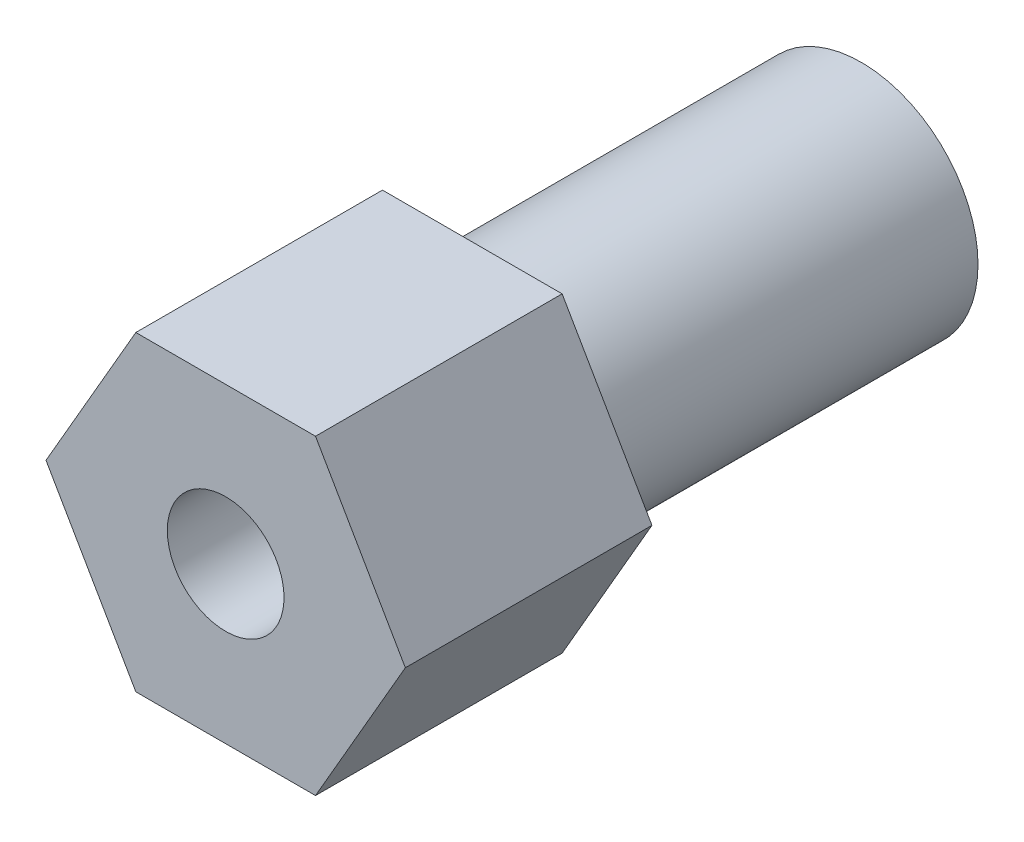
ISO-10303-21;
HEADER;
FILE_DESCRIPTION(('STEP AP214'),'2;1');
FILE_NAME('part.step','',(''),(''),'','','');
FILE_SCHEMA(('AUTOMOTIVE_DESIGN { 1 0 10303 214 1 1 1 1 }'));
ENDSEC;
DATA;
#1=APPLICATION_CONTEXT('core data for automotive mechanical design processes');
#2=APPLICATION_PROTOCOL_DEFINITION('international standard','automotive_design',2000,#1);
#3=PRODUCT_CONTEXT('',#1,'mechanical');
#4=PRODUCT('Part','Part','',(#3));
#5=PRODUCT_RELATED_PRODUCT_CATEGORY('part','',(#4));
#6=PRODUCT_DEFINITION_FORMATION('','',#4);
#7=PRODUCT_DEFINITION_CONTEXT('part definition',#1,'design');
#8=PRODUCT_DEFINITION('design','',#6,#7);
#9=PRODUCT_DEFINITION_SHAPE('','',#8);
#10=(LENGTH_UNIT() NAMED_UNIT(*) SI_UNIT(.MILLI.,.METRE.));
#11=(NAMED_UNIT(*) PLANE_ANGLE_UNIT() SI_UNIT($,.RADIAN.));
#12=(NAMED_UNIT(*) SI_UNIT($,.STERADIAN.) SOLID_ANGLE_UNIT());
#13=UNCERTAINTY_MEASURE_WITH_UNIT(LENGTH_MEASURE(1.E-05),#10,'distance_accuracy_value','');
#14=(GEOMETRIC_REPRESENTATION_CONTEXT(3) GLOBAL_UNCERTAINTY_ASSIGNED_CONTEXT((#13)) GLOBAL_UNIT_ASSIGNED_CONTEXT((#10,
#11,#12)) REPRESENTATION_CONTEXT('',''));
#15=CARTESIAN_POINT('',(0.,0.,0.));
#16=DIRECTION('',(0.,0.,1.));
#17=DIRECTION('',(1.,0.,0.));
#18=AXIS2_PLACEMENT_3D('',#15,#16,#17);
#19=CARTESIAN_POINT('',(-2.30940107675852,-4.00000000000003,0.));
#20=DIRECTION('',(0.,0.,-0.999999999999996));
#21=DIRECTION('',(-0.999999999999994,0.,0.));
#22=AXIS2_PLACEMENT_3D('',#19,#20,#21);
#23=PLANE('',#22);
#24=DIRECTION('',(0.999999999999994,0.,0.));
#25=VECTOR('',#24,1.);
#26=CARTESIAN_POINT('',(-2.30940107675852,-4.00000000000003,0.));
#27=LINE('',#26,#25);
#28=CARTESIAN_POINT('',(-2.30940107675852,-4.00000000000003,0.));
#29=VERTEX_POINT('',#28);
#30=CARTESIAN_POINT('',(2.3094010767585,-4.,0.));
#31=VERTEX_POINT('',#30);
#32=EDGE_CURVE('E89',#29,#31,#27,.T.);
#33=ORIENTED_EDGE('',*,*,#32,.F.);
#34=DIRECTION('',(0.499999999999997,-0.866025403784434,0.));
#35=VECTOR('',#34,1.);
#36=CARTESIAN_POINT('',(-4.61880215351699,0.,0.));
#37=LINE('',#36,#35);
#38=CARTESIAN_POINT('',(-4.61880215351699,0.,0.));
#39=VERTEX_POINT('',#38);
#40=EDGE_CURVE('E115',#39,#29,#37,.T.);
#41=ORIENTED_EDGE('',*,*,#40,.F.);
#42=DIRECTION('',(-0.499999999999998,-0.866025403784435,0.));
#43=VECTOR('',#42,1.);
#44=CARTESIAN_POINT('',(-2.30940107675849,3.99999999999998,0.));
#45=LINE('',#44,#43);
#46=CARTESIAN_POINT('',(-2.30940107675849,3.99999999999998,0.));
#47=VERTEX_POINT('',#46);
#48=EDGE_CURVE('E113',#47,#39,#45,.T.);
#49=ORIENTED_EDGE('',*,*,#48,.F.);
#50=DIRECTION('',(-0.999999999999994,0.,0.));
#51=VECTOR('',#50,1.);
#52=CARTESIAN_POINT('',(2.30940107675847,3.99999999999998,0.));
#53=LINE('',#52,#51);
#54=CARTESIAN_POINT('',(2.30940107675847,3.99999999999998,0.));
#55=VERTEX_POINT('',#54);
#56=EDGE_CURVE('E111',#55,#47,#53,.T.);
#57=ORIENTED_EDGE('',*,*,#56,.F.);
#58=DIRECTION('',(-0.499999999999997,0.866025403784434,0.));
#59=VECTOR('',#58,1.);
#60=CARTESIAN_POINT('',(4.61880215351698,0.,0.));
#61=LINE('',#60,#59);
#62=CARTESIAN_POINT('',(4.61880215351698,0.,0.));
#63=VERTEX_POINT('',#62);
#64=EDGE_CURVE('E91',#63,#55,#61,.T.);
#65=ORIENTED_EDGE('',*,*,#64,.F.);
#66=DIRECTION('',(0.499999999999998,0.866025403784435,0.));
#67=VECTOR('',#66,1.);
#68=CARTESIAN_POINT('',(2.3094010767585,-4.,0.));
#69=LINE('',#68,#67);
#70=EDGE_CURVE('E85',#31,#63,#69,.T.);
#71=ORIENTED_EDGE('',*,*,#70,.F.);
#72=EDGE_LOOP('',(#33,#41,#49,#57,#65,#71));
#73=FACE_BOUND('',#72,.T.);
#74=CARTESIAN_POINT('',(0.,0.,0.));
#75=DIRECTION('',(0.,0.,-0.999999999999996));
#76=DIRECTION('',(-0.999999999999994,0.,0.));
#77=AXIS2_PLACEMENT_3D('',#74,#75,#76);
#78=CIRCLE('',#77,3.);
#79=CARTESIAN_POINT('',(2.99999999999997,0.,0.));
#80=VERTEX_POINT('',#79);
#81=EDGE_CURVE('E106',#80,#80,#78,.T.);
#82=ORIENTED_EDGE('',*,*,#81,.F.);
#83=EDGE_LOOP('',(#82));
#84=FACE_BOUND('',#83,.T.);
#85=ADVANCED_FACE('F32',(#73,#84),#23,.T.);
#86=CARTESIAN_POINT('',(-2.30940107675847,-3.99999999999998,6.33999999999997));
#87=DIRECTION('',(0.,0.999999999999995,0.));
#88=DIRECTION('',(-0.999999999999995,0.,0.));
#89=AXIS2_PLACEMENT_3D('',#86,#87,#88);
#90=PLANE('',#89);
#91=ORIENTED_EDGE('',*,*,#32,.T.);
#92=DIRECTION('',(0.,0.,-0.999999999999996));
#93=VECTOR('',#92,1.);
#94=CARTESIAN_POINT('',(2.30940107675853,-3.99999999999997,6.33999999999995));
#95=LINE('',#94,#93);
#96=CARTESIAN_POINT('',(2.30940107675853,-3.99999999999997,6.33999999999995));
#97=VERTEX_POINT('',#96);
#98=EDGE_CURVE('E11',#97,#31,#95,.T.);
#99=ORIENTED_EDGE('',*,*,#98,.F.);
#100=DIRECTION('',(0.999999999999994,0.,0.));
#101=VECTOR('',#100,1.);
#102=CARTESIAN_POINT('',(-2.30940107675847,-3.99999999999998,6.33999999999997));
#103=LINE('',#102,#101);
#104=CARTESIAN_POINT('',(-2.30940107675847,-3.99999999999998,6.33999999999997));
#105=VERTEX_POINT('',#104);
#106=EDGE_CURVE('E117',#105,#97,#103,.T.);
#107=ORIENTED_EDGE('',*,*,#106,.F.);
#108=DIRECTION('',(0.,0.,-0.999999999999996));
#109=VECTOR('',#108,1.);
#110=CARTESIAN_POINT('',(-2.30940107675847,-3.99999999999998,6.33999999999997));
#111=LINE('',#110,#109);
#112=EDGE_CURVE('E102',#105,#29,#111,.T.);
#113=ORIENTED_EDGE('',*,*,#112,.T.);
#114=EDGE_LOOP('',(#91,#99,#107,#113));
#115=FACE_BOUND('',#114,.T.);
#116=ADVANCED_FACE('F34',(#115),#90,.F.);
#117=CARTESIAN_POINT('',(2.30940107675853,-3.99999999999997,6.33999999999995));
#118=DIRECTION('',(-0.866025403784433,0.499999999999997,0.));
#119=DIRECTION('',(-0.499999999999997,-0.866025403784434,0.));
#120=AXIS2_PLACEMENT_3D('',#117,#118,#119);
#121=PLANE('',#120);
#122=ORIENTED_EDGE('',*,*,#70,.T.);
#123=DIRECTION('',(0.,0.,-0.999999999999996));
#124=VECTOR('',#123,1.);
#125=CARTESIAN_POINT('',(4.61880215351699,0.,6.33999999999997));
#126=LINE('',#125,#124);
#127=CARTESIAN_POINT('',(4.61880215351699,0.,6.33999999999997));
#128=VERTEX_POINT('',#127);
#129=EDGE_CURVE('E40',#128,#63,#126,.T.);
#130=ORIENTED_EDGE('',*,*,#129,.F.);
#131=DIRECTION('',(0.499999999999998,0.866025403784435,0.));
#132=VECTOR('',#131,1.);
#133=CARTESIAN_POINT('',(2.30940107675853,-3.99999999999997,6.33999999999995));
#134=LINE('',#133,#132);
#135=EDGE_CURVE('E98',#97,#128,#134,.T.);
#136=ORIENTED_EDGE('',*,*,#135,.F.);
#137=ORIENTED_EDGE('',*,*,#98,.T.);
#138=EDGE_LOOP('',(#122,#130,#136,#137));
#139=FACE_BOUND('',#138,.T.);
#140=ADVANCED_FACE('F97',(#139),#121,.F.);
#141=CARTESIAN_POINT('',(4.61880215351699,0.,6.33999999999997));
#142=DIRECTION('',(-0.866025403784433,-0.499999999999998,0.));
#143=DIRECTION('',(0.499999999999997,-0.866025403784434,0.));
#144=AXIS2_PLACEMENT_3D('',#141,#142,#143);
#145=PLANE('',#144);
#146=ORIENTED_EDGE('',*,*,#64,.T.);
#147=DIRECTION('',(0.,0.,-0.999999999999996));
#148=VECTOR('',#147,1.);
#149=CARTESIAN_POINT('',(2.30940107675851,3.99999999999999,6.33999999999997));
#150=LINE('',#149,#148);
#151=CARTESIAN_POINT('',(2.30940107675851,3.99999999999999,6.33999999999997));
#152=VERTEX_POINT('',#151);
#153=EDGE_CURVE('E133',#152,#55,#150,.T.);
#154=ORIENTED_EDGE('',*,*,#153,.F.);
#155=DIRECTION('',(-0.499999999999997,0.866025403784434,0.));
#156=VECTOR('',#155,1.);
#157=CARTESIAN_POINT('',(4.61880215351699,0.,6.33999999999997));
#158=LINE('',#157,#156);
#159=EDGE_CURVE('E120',#128,#152,#158,.T.);
#160=ORIENTED_EDGE('',*,*,#159,.F.);
#161=ORIENTED_EDGE('',*,*,#129,.T.);
#162=EDGE_LOOP('',(#146,#154,#160,#161));
#163=FACE_BOUND('',#162,.T.);
#164=ADVANCED_FACE('F137',(#163),#145,.F.);
#165=CARTESIAN_POINT('',(2.30940107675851,3.99999999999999,6.33999999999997));
#166=DIRECTION('',(0.,-0.999999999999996,0.));
#167=DIRECTION('',(0.,0.,-0.999999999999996));
#168=AXIS2_PLACEMENT_3D('',#165,#166,#167);
#169=PLANE('',#168);
#170=ORIENTED_EDGE('',*,*,#56,.T.);
#171=DIRECTION('',(0.,0.,-0.999999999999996));
#172=VECTOR('',#171,1.);
#173=CARTESIAN_POINT('',(-2.30940107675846,3.99999999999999,6.34000000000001));
#174=LINE('',#173,#172);
#175=CARTESIAN_POINT('',(-2.30940107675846,3.99999999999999,6.34000000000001));
#176=VERTEX_POINT('',#175);
#177=EDGE_CURVE('E130',#176,#47,#174,.T.);
#178=ORIENTED_EDGE('',*,*,#177,.F.);
#179=DIRECTION('',(-0.999999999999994,0.,0.));
#180=VECTOR('',#179,1.);
#181=CARTESIAN_POINT('',(2.30940107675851,3.99999999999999,6.33999999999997));
#182=LINE('',#181,#180);
#183=EDGE_CURVE('E122',#152,#176,#182,.T.);
#184=ORIENTED_EDGE('',*,*,#183,.F.);
#185=ORIENTED_EDGE('',*,*,#153,.T.);
#186=EDGE_LOOP('',(#170,#178,#184,#185));
#187=FACE_BOUND('',#186,.T.);
#188=ADVANCED_FACE('F143',(#187),#169,.F.);
#189=CARTESIAN_POINT('',(-2.30940107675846,3.99999999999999,6.34000000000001));
#190=DIRECTION('',(0.866025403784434,-0.499999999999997,0.));
#191=DIRECTION('',(0.499999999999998,0.866025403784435,0.));
#192=AXIS2_PLACEMENT_3D('',#189,#190,#191);
#193=PLANE('',#192);
#194=ORIENTED_EDGE('',*,*,#48,.T.);
#195=DIRECTION('',(0.,0.,-0.999999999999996));
#196=VECTOR('',#195,1.);
#197=CARTESIAN_POINT('',(-4.61880215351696,0.,6.33999999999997));
#198=LINE('',#197,#196);
#199=CARTESIAN_POINT('',(-4.61880215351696,0.,6.33999999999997));
#200=VERTEX_POINT('',#199);
#201=EDGE_CURVE('E127',#200,#39,#198,.T.);
#202=ORIENTED_EDGE('',*,*,#201,.F.);
#203=DIRECTION('',(-0.499999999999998,-0.866025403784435,0.));
#204=VECTOR('',#203,1.);
#205=CARTESIAN_POINT('',(-2.30940107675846,3.99999999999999,6.34000000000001));
#206=LINE('',#205,#204);
#207=EDGE_CURVE('E52',#176,#200,#206,.T.);
#208=ORIENTED_EDGE('',*,*,#207,.F.);
#209=ORIENTED_EDGE('',*,*,#177,.T.);
#210=EDGE_LOOP('',(#194,#202,#208,#209));
#211=FACE_BOUND('',#210,.T.);
#212=ADVANCED_FACE('F146',(#211),#193,.F.);
#213=CARTESIAN_POINT('',(-4.61880215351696,0.,6.33999999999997));
#214=DIRECTION('',(0.866025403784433,0.499999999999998,0.));
#215=DIRECTION('',(-0.499999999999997,0.866025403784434,0.));
#216=AXIS2_PLACEMENT_3D('',#213,#214,#215);
#217=PLANE('',#216);
#218=ORIENTED_EDGE('',*,*,#40,.T.);
#219=ORIENTED_EDGE('',*,*,#112,.F.);
#220=DIRECTION('',(0.499999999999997,-0.866025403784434,0.));
#221=VECTOR('',#220,1.);
#222=CARTESIAN_POINT('',(-4.61880215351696,0.,6.33999999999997));
#223=LINE('',#222,#221);
#224=EDGE_CURVE('E47',#200,#105,#223,.T.);
#225=ORIENTED_EDGE('',*,*,#224,.F.);
#226=ORIENTED_EDGE('',*,*,#201,.T.);
#227=EDGE_LOOP('',(#218,#219,#225,#226));
#228=FACE_BOUND('',#227,.T.);
#229=ADVANCED_FACE('F148',(#228),#217,.F.);
#230=CARTESIAN_POINT('',(-2.30940107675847,-3.99999999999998,6.33999999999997));
#231=DIRECTION('',(0.,0.,-0.999999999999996));
#232=DIRECTION('',(-0.999999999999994,0.,0.));
#233=AXIS2_PLACEMENT_3D('',#230,#231,#232);
#234=PLANE('',#233);
#235=CARTESIAN_POINT('',(0.,0.,6.33999999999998));
#236=DIRECTION('',(0.,0.,-0.999999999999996));
#237=DIRECTION('',(-0.999999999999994,0.,0.));
#238=AXIS2_PLACEMENT_3D('',#235,#236,#237);
#239=CIRCLE('',#238,1.5);
#240=CARTESIAN_POINT('',(-1.49999999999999,0.,6.33999999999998));
#241=VERTEX_POINT('',#240);
#242=EDGE_CURVE('E180',#241,#241,#239,.T.);
#243=ORIENTED_EDGE('',*,*,#242,.T.);
#244=EDGE_LOOP('',(#243));
#245=FACE_BOUND('',#244,.T.);
#246=ORIENTED_EDGE('',*,*,#106,.T.);
#247=ORIENTED_EDGE('',*,*,#135,.T.);
#248=ORIENTED_EDGE('',*,*,#159,.T.);
#249=ORIENTED_EDGE('',*,*,#183,.T.);
#250=ORIENTED_EDGE('',*,*,#207,.T.);
#251=ORIENTED_EDGE('',*,*,#224,.T.);
#252=EDGE_LOOP('',(#246,#247,#248,#249,#250,#251));
#253=FACE_BOUND('',#252,.T.);
#254=ADVANCED_FACE('F140',(#245,#253),#234,.F.);
#255=CARTESIAN_POINT('',(0.,0.,-9.99999999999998));
#256=DIRECTION('',(0.,0.,0.999999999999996));
#257=DIRECTION('',(0.999999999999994,0.,0.));
#258=AXIS2_PLACEMENT_3D('',#255,#256,#257);
#259=CYLINDRICAL_SURFACE('',#258,3.);
#260=CARTESIAN_POINT('',(0.,0.,-9.99999999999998));
#261=DIRECTION('',(0.,0.,-0.999999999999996));
#262=DIRECTION('',(-0.999999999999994,0.,0.));
#263=AXIS2_PLACEMENT_3D('',#260,#261,#262);
#264=CIRCLE('',#263,3.);
#265=CARTESIAN_POINT('',(2.99999999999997,0.,-9.99999999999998));
#266=VERTEX_POINT('',#265);
#267=EDGE_CURVE('E103',#266,#266,#264,.T.);
#268=CARTESIAN_POINT('',(2.99999999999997,0.,-9.99999999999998));
#269=CARTESIAN_POINT('',(2.99999999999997,0.,-9.89583333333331));
#270=CARTESIAN_POINT('',(2.99999999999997,0.,-9.79166666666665));
#271=CARTESIAN_POINT('',(2.99999999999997,0.,-9.58333333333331));
#272=CARTESIAN_POINT('',(2.99999999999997,0.,-9.47916666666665));
#273=CARTESIAN_POINT('',(2.99999999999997,0.,-9.27083333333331));
#274=CARTESIAN_POINT('',(2.99999999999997,0.,-9.16666666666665));
#275=CARTESIAN_POINT('',(2.99999999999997,0.,-8.95833333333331));
#276=CARTESIAN_POINT('',(2.99999999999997,0.,-8.85416666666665));
#277=CARTESIAN_POINT('',(2.99999999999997,0.,-8.64583333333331));
#278=CARTESIAN_POINT('',(2.99999999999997,0.,-8.54166666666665));
#279=CARTESIAN_POINT('',(2.99999999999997,0.,-8.33333333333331));
#280=CARTESIAN_POINT('',(2.99999999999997,0.,-8.22916666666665));
#281=CARTESIAN_POINT('',(2.99999999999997,0.,-8.02083333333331));
#282=CARTESIAN_POINT('',(2.99999999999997,0.,-7.91666666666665));
#283=CARTESIAN_POINT('',(2.99999999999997,0.,-7.70833333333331));
#284=CARTESIAN_POINT('',(2.99999999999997,0.,-7.60416666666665));
#285=CARTESIAN_POINT('',(2.99999999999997,0.,-7.39583333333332));
#286=CARTESIAN_POINT('',(2.99999999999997,0.,-7.29166666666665));
#287=CARTESIAN_POINT('',(2.99999999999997,0.,-7.08333333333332));
#288=CARTESIAN_POINT('',(2.99999999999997,0.,-6.97916666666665));
#289=CARTESIAN_POINT('',(2.99999999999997,0.,-6.77083333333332));
#290=CARTESIAN_POINT('',(2.99999999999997,0.,-6.66666666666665));
#291=CARTESIAN_POINT('',(2.99999999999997,0.,-6.45833333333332));
#292=CARTESIAN_POINT('',(2.99999999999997,0.,-6.35416666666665));
#293=CARTESIAN_POINT('',(2.99999999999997,0.,-6.14583333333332));
#294=CARTESIAN_POINT('',(2.99999999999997,0.,-6.04166666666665));
#295=CARTESIAN_POINT('',(2.99999999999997,0.,-5.83333333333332));
#296=CARTESIAN_POINT('',(2.99999999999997,0.,-5.72916666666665));
#297=CARTESIAN_POINT('',(2.99999999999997,0.,-5.52083333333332));
#298=CARTESIAN_POINT('',(2.99999999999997,0.,-5.41666666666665));
#299=CARTESIAN_POINT('',(2.99999999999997,0.,-5.20833333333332));
#300=CARTESIAN_POINT('',(2.99999999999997,0.,-5.10416666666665));
#301=CARTESIAN_POINT('',(2.99999999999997,0.,-4.89583333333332));
#302=CARTESIAN_POINT('',(2.99999999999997,0.,-4.79166666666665));
#303=CARTESIAN_POINT('',(2.99999999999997,0.,-4.58333333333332));
#304=CARTESIAN_POINT('',(2.99999999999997,0.,-4.47916666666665));
#305=CARTESIAN_POINT('',(2.99999999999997,0.,-4.27083333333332));
#306=CARTESIAN_POINT('',(2.99999999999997,0.,-4.16666666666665));
#307=CARTESIAN_POINT('',(2.99999999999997,0.,-3.95833333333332));
#308=CARTESIAN_POINT('',(2.99999999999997,0.,-3.85416666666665));
#309=CARTESIAN_POINT('',(2.99999999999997,0.,-3.64583333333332));
#310=CARTESIAN_POINT('',(2.99999999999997,0.,-3.54166666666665));
#311=CARTESIAN_POINT('',(2.99999999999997,0.,-3.33333333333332));
#312=CARTESIAN_POINT('',(2.99999999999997,0.,-3.22916666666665));
#313=CARTESIAN_POINT('',(2.99999999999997,0.,-3.02083333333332));
#314=CARTESIAN_POINT('',(2.99999999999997,0.,-2.91666666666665));
#315=CARTESIAN_POINT('',(2.99999999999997,0.,-2.70833333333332));
#316=CARTESIAN_POINT('',(2.99999999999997,0.,-2.60416666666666));
#317=CARTESIAN_POINT('',(2.99999999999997,0.,-2.39583333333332));
#318=CARTESIAN_POINT('',(2.99999999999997,0.,-2.29166666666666));
#319=CARTESIAN_POINT('',(2.99999999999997,0.,-2.08333333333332));
#320=CARTESIAN_POINT('',(2.99999999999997,0.,-1.97916666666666));
#321=CARTESIAN_POINT('',(2.99999999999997,0.,-1.77083333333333));
#322=CARTESIAN_POINT('',(2.99999999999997,0.,-1.66666666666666));
#323=CARTESIAN_POINT('',(2.99999999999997,0.,-1.45833333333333));
#324=CARTESIAN_POINT('',(2.99999999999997,0.,-1.35416666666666));
#325=CARTESIAN_POINT('',(2.99999999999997,0.,-1.14583333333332));
#326=CARTESIAN_POINT('',(2.99999999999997,0.,-1.04166666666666));
#327=CARTESIAN_POINT('',(2.99999999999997,0.,-0.833333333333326));
#328=CARTESIAN_POINT('',(2.99999999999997,0.,-0.72916666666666));
#329=CARTESIAN_POINT('',(2.99999999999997,0.,-0.520833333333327));
#330=CARTESIAN_POINT('',(2.99999999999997,0.,-0.41666666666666));
#331=CARTESIAN_POINT('',(2.99999999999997,0.,-0.208333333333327));
#332=CARTESIAN_POINT('',(2.99999999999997,0.,-0.10416666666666));
#333=CARTESIAN_POINT('',(2.99999999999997,0.,0.));
#334=B_SPLINE_CURVE_WITH_KNOTS('',3,(#268,#269,#270,#271,#272,#273,#274,#275,#276,#277,#278,
#279,#280,#281,#282,#283,#284,#285,#286,#287,#288,#289,#290,#291,#292,#293,#294,#295,#296,#297,
#298,#299,#300,#301,#302,#303,#304,#305,#306,#307,#308,#309,#310,#311,#312,#313,#314,#315,#316,
#317,#318,#319,#320,#321,#322,#323,#324,#325,#326,#327,#328,#329,#330,#331,#332,#333),
.UNSPECIFIED.,.F.,.F.,(4,2,2,2,2,2,2,2,2,2,2,2,2,2,2,2,2,2,2,2,2,2,2,2,2,2,2,2,2,2,2,2,4),(0.,
0.3125,0.625000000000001,0.937499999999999,1.25,1.5625,1.875,2.1875,2.5,2.8125,3.125,3.4375,
3.75,4.06249999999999,4.375,4.68749999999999,4.99999999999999,5.31249999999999,5.62499999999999,
5.93749999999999,6.24999999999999,6.56249999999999,6.87499999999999,7.18749999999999,
7.49999999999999,7.81249999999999,8.12499999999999,8.43749999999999,8.74999999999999,
9.06249999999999,9.37499999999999,9.68749999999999,9.99999999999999),.UNSPECIFIED.);
#335=EDGE_CURVE('BSEAM155',#266,#80,#334,.T.);
#336=ORIENTED_EDGE('',*,*,#267,.F.);
#337=ORIENTED_EDGE('',*,*,#81,.T.);
#338=ORIENTED_EDGE('',*,*,#335,.T.);
#339=ORIENTED_EDGE('',*,*,#335,.F.);
#340=EDGE_LOOP('',(#336,#338,#337,#339));
#341=FACE_BOUND('',#340,.T.);
#342=ADVANCED_FACE('F155',(#341),#259,.T.);
#343=CARTESIAN_POINT('',(0.,0.,-9.99999999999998));
#344=DIRECTION('',(0.,0.,-0.999999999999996));
#345=DIRECTION('',(-0.999999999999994,0.,0.));
#346=AXIS2_PLACEMENT_3D('',#343,#344,#345);
#347=PLANE('',#346);
#348=CARTESIAN_POINT('',(0.,0.,-9.99999999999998));
#349=DIRECTION('',(0.,0.,-0.999999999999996));
#350=DIRECTION('',(-0.999999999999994,0.,0.));
#351=AXIS2_PLACEMENT_3D('',#348,#349,#350);
#352=CIRCLE('',#351,1.5);
#353=CARTESIAN_POINT('',(-1.49999999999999,0.,-9.99999999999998));
#354=VERTEX_POINT('',#353);
#355=EDGE_CURVE('E183',#354,#354,#352,.T.);
#356=ORIENTED_EDGE('',*,*,#355,.F.);
#357=EDGE_LOOP('',(#356));
#358=FACE_BOUND('',#357,.T.);
#359=ORIENTED_EDGE('',*,*,#267,.T.);
#360=EDGE_LOOP('',(#359));
#361=FACE_BOUND('',#360,.T.);
#362=ADVANCED_FACE('F167',(#358,#361),#347,.T.);
#363=CARTESIAN_POINT('',(0.,0.,6.33999999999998));
#364=DIRECTION('',(0.,0.,-0.999999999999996));
#365=DIRECTION('',(-0.999999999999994,0.,0.));
#366=AXIS2_PLACEMENT_3D('',#363,#364,#365);
#367=CYLINDRICAL_SURFACE('',#366,1.5);
#368=CARTESIAN_POINT('',(-1.49999999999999,0.,6.33999999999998));
#369=CARTESIAN_POINT('',(-1.49999999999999,0.,6.16979166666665));
#370=CARTESIAN_POINT('',(-1.49999999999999,0.,5.99958333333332));
#371=CARTESIAN_POINT('',(-1.49999999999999,0.,5.65916666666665));
#372=CARTESIAN_POINT('',(-1.49999999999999,0.,5.48895833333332));
#373=CARTESIAN_POINT('',(-1.49999999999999,0.,5.14854166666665));
#374=CARTESIAN_POINT('',(-1.49999999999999,0.,4.97833333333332));
#375=CARTESIAN_POINT('',(-1.49999999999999,0.,4.63791666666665));
#376=CARTESIAN_POINT('',(-1.49999999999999,0.,4.46770833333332));
#377=CARTESIAN_POINT('',(-1.49999999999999,0.,4.12729166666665));
#378=CARTESIAN_POINT('',(-1.49999999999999,0.,3.95708333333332));
#379=CARTESIAN_POINT('',(-1.49999999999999,0.,3.61666666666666));
#380=CARTESIAN_POINT('',(-1.49999999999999,0.,3.44645833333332));
#381=CARTESIAN_POINT('',(-1.49999999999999,0.,3.10604166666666));
#382=CARTESIAN_POINT('',(-1.49999999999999,0.,2.93583333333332));
#383=CARTESIAN_POINT('',(-1.49999999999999,0.,2.59541666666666));
#384=CARTESIAN_POINT('',(-1.49999999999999,0.,2.42520833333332));
#385=CARTESIAN_POINT('',(-1.49999999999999,0.,2.08479166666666));
#386=CARTESIAN_POINT('',(-1.49999999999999,0.,1.91458333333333));
#387=CARTESIAN_POINT('',(-1.49999999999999,0.,1.57416666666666));
#388=CARTESIAN_POINT('',(-1.49999999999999,0.,1.40395833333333));
#389=CARTESIAN_POINT('',(-1.49999999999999,0.,1.06354166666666));
#390=CARTESIAN_POINT('',(-1.49999999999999,0.,0.893333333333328));
#391=CARTESIAN_POINT('',(-1.49999999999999,0.,0.552916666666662));
#392=CARTESIAN_POINT('',(-1.49999999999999,0.,0.382708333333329));
#393=CARTESIAN_POINT('',(-1.49999999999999,0.,0.0422916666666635));
#394=CARTESIAN_POINT('',(-1.49999999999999,0.,-0.127916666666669));
#395=CARTESIAN_POINT('',(-1.49999999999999,0.,-0.468333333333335));
#396=CARTESIAN_POINT('',(-1.49999999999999,0.,-0.638541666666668));
#397=CARTESIAN_POINT('',(-1.49999999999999,0.,-0.978958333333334));
#398=CARTESIAN_POINT('',(-1.49999999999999,0.,-1.14916666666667));
#399=CARTESIAN_POINT('',(-1.49999999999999,0.,-1.48958333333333));
#400=CARTESIAN_POINT('',(-1.49999999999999,0.,-1.65979166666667));
#401=CARTESIAN_POINT('',(-1.49999999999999,0.,-2.00020833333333));
#402=CARTESIAN_POINT('',(-1.49999999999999,0.,-2.17041666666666));
#403=CARTESIAN_POINT('',(-1.49999999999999,0.,-2.51083333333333));
#404=CARTESIAN_POINT('',(-1.49999999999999,0.,-2.68104166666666));
#405=CARTESIAN_POINT('',(-1.49999999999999,0.,-3.02145833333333));
#406=CARTESIAN_POINT('',(-1.49999999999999,0.,-3.19166666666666));
#407=CARTESIAN_POINT('',(-1.49999999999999,0.,-3.53208333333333));
#408=CARTESIAN_POINT('',(-1.49999999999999,0.,-3.70229166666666));
#409=CARTESIAN_POINT('',(-1.49999999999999,0.,-4.04270833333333));
#410=CARTESIAN_POINT('',(-1.49999999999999,0.,-4.21291666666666));
#411=CARTESIAN_POINT('',(-1.49999999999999,0.,-4.55333333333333));
#412=CARTESIAN_POINT('',(-1.49999999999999,0.,-4.72354166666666));
#413=CARTESIAN_POINT('',(-1.49999999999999,0.,-5.06395833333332));
#414=CARTESIAN_POINT('',(-1.49999999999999,0.,-5.23416666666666));
#415=CARTESIAN_POINT('',(-1.49999999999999,0.,-5.57458333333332));
#416=CARTESIAN_POINT('',(-1.49999999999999,0.,-5.74479166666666));
#417=CARTESIAN_POINT('',(-1.49999999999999,0.,-6.08520833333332));
#418=CARTESIAN_POINT('',(-1.49999999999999,0.,-6.25541666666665));
#419=CARTESIAN_POINT('',(-1.49999999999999,0.,-6.59583333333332));
#420=CARTESIAN_POINT('',(-1.49999999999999,0.,-6.76604166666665));
#421=CARTESIAN_POINT('',(-1.49999999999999,0.,-7.10645833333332));
#422=CARTESIAN_POINT('',(-1.49999999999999,0.,-7.27666666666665));
#423=CARTESIAN_POINT('',(-1.49999999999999,0.,-7.61708333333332));
#424=CARTESIAN_POINT('',(-1.49999999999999,0.,-7.78729166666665));
#425=CARTESIAN_POINT('',(-1.49999999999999,0.,-8.12770833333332));
#426=CARTESIAN_POINT('',(-1.49999999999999,0.,-8.29791666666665));
#427=CARTESIAN_POINT('',(-1.49999999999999,0.,-8.63833333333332));
#428=CARTESIAN_POINT('',(-1.49999999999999,0.,-8.80854166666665));
#429=CARTESIAN_POINT('',(-1.49999999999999,0.,-9.14895833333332));
#430=CARTESIAN_POINT('',(-1.49999999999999,0.,-9.31916666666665));
#431=CARTESIAN_POINT('',(-1.49999999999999,0.,-9.65958333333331));
#432=CARTESIAN_POINT('',(-1.5,0.,-9.82979166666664));
#433=CARTESIAN_POINT('',(-1.49999999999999,0.,-9.99999999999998));
#434=B_SPLINE_CURVE_WITH_KNOTS('',3,(#368,#369,#370,#371,#372,#373,#374,#375,#376,#377,#378,
#379,#380,#381,#382,#383,#384,#385,#386,#387,#388,#389,#390,#391,#392,#393,#394,#395,#396,#397,
#398,#399,#400,#401,#402,#403,#404,#405,#406,#407,#408,#409,#410,#411,#412,#413,#414,#415,#416,
#417,#418,#419,#420,#421,#422,#423,#424,#425,#426,#427,#428,#429,#430,#431,#432,#433),
.UNSPECIFIED.,.F.,.F.,(4,2,2,2,2,2,2,2,2,2,2,2,2,2,2,2,2,2,2,2,2,2,2,2,2,2,2,2,2,2,2,2,4),(0.,
0.510624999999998,1.02125,1.531875,2.04249999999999,2.55312499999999,3.06374999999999,
3.57437499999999,4.08499999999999,4.59562499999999,5.10624999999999,5.61687499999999,
6.12749999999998,6.63812499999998,7.14874999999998,7.65937499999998,8.16999999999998,
8.68062499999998,9.19124999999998,9.70187499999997,10.2125,10.723125,11.23375,11.744375,12.255,
12.765625,13.27625,13.786875,14.2975,14.808125,15.31875,15.829375,16.34),.UNSPECIFIED.);
#435=EDGE_CURVE('BSEAM171',#241,#354,#434,.T.);
#436=ORIENTED_EDGE('',*,*,#242,.F.);
#437=ORIENTED_EDGE('',*,*,#355,.T.);
#438=ORIENTED_EDGE('',*,*,#435,.T.);
#439=ORIENTED_EDGE('',*,*,#435,.F.);
#440=EDGE_LOOP('',(#436,#438,#437,#439));
#441=FACE_BOUND('',#440,.T.);
#442=ADVANCED_FACE('F171',(#441),#367,.F.);
#443=CLOSED_SHELL('',(#85,#116,#140,#164,#188,#212,#229,#254,#342,#362,#442));
#444=MANIFOLD_SOLID_BREP('B2',#443);
#445=ADVANCED_BREP_SHAPE_REPRESENTATION('',(#18,#444),#14);
#446=SHAPE_DEFINITION_REPRESENTATION(#9,#445);
ENDSEC;
END-ISO-10303-21;
